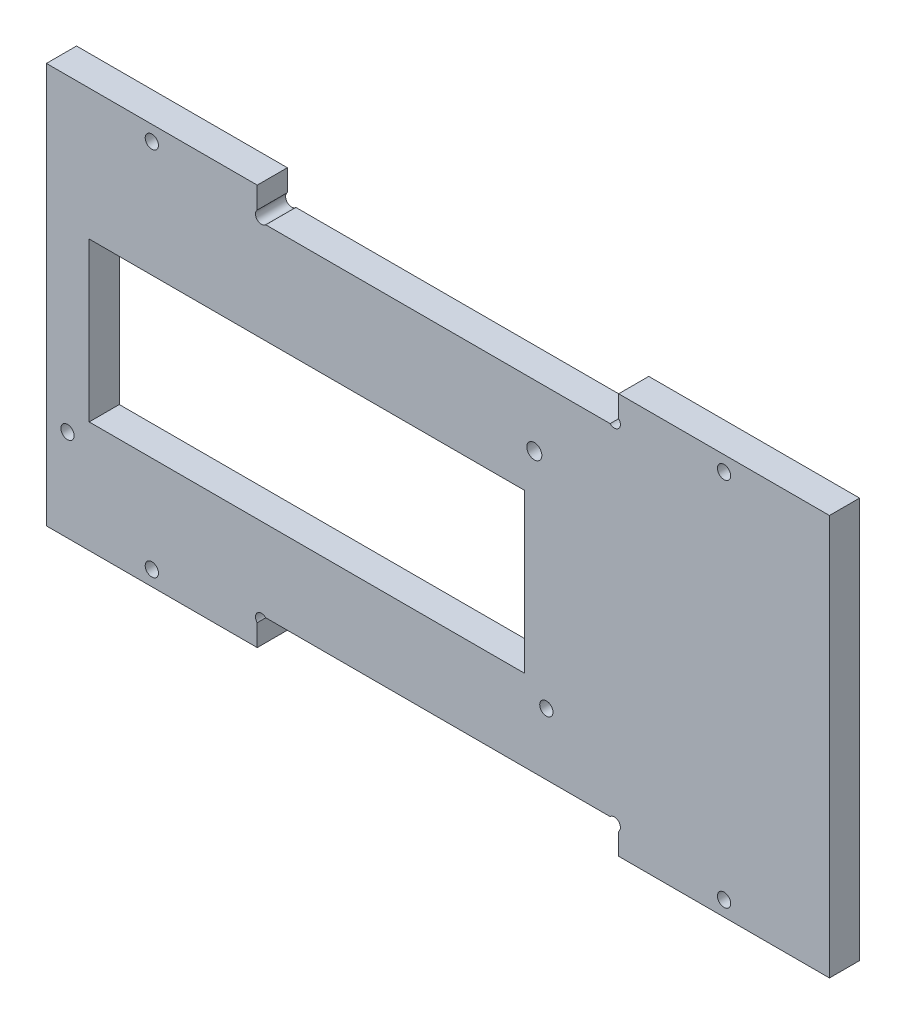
from build123d import *

# Parameters (mm, degrees)
ESQUISSE1_W               = 130
ESQUISSE1_H               = 66.5
BOSS_EXTRU_1_DEPTH        = 5
ENL_V_MAT_EXTRU_1_REACH   = 148.107
ESQUISSE2_R               = 1.25
ESQUISSE2_R_2             = 1.1
ENL_V_MAT_EXTRU_2_REACH   = 148.107
ESQUISSE3_W               = 72.3
ESQUISSE3_H               = 26.3
ENL_V_MAT_EXTRU_4_REACH   = 148.107
ESQUISSE6_W               = 60
ESQUISSE6_H               = 5
ENL_V_START               = -5
ESQUISSE7_R               = 1
ENL_V_MAT_EXTRU_5_DEPTH   = 5
ENL_V_MAT_EXTRU_6_REACH   = 148.107
ESQUISSE8_R               = 1.1
SYM_TRIE2_COPY_1_REACH    = 148.107
SYM_TRIE2_COPY_1_SKETCH_R = 1.1
ESQUISSE10_W              = 40
ESQUISSE10_H              = 6.5
ENL_V_MAT_EXTRU_7_DEPTH   = 1


with BuildPart() as part:
    # Esquisse1 → Boss.-Extru.1 (new body)
    with BuildSketch(Plane.XY):
        with Locations((65, 33.25)):
            Rectangle(ESQUISSE1_W, ESQUISSE1_H)
    extrude(amount=BOSS_EXTRU_1_DEPTH)

    # Esquisse2 → Enl_v. mat.-Extru.1 (cut, up to next)
    with BuildSketch(Plane.XY.offset(5), mode=Mode.PRIVATE) as enl_v_mat_extru_1_sk1:
        with Locations((81, 51.25)):
            Circle(ESQUISSE2_R)
    enl_v_mat_extru_1_tool1 = extrude(enl_v_mat_extru_1_sk1.sketch, amount=-ENL_V_MAT_EXTRU_1_REACH, mode=Mode.PRIVATE) & part.part
    # Esquisse2 → Enl_v. mat.-Extru.1 (cut, up to next)
    with BuildSketch(Plane.XY.offset(5), mode=Mode.PRIVATE) as enl_v_mat_extru_1_sk2:
        with Locations((83, 15.25)):
            Circle(ESQUISSE2_R_2)
    enl_v_mat_extru_1_tool2 = extrude(enl_v_mat_extru_1_sk2.sketch, amount=-ENL_V_MAT_EXTRU_1_REACH, mode=Mode.PRIVATE) & part.part
    # Esquisse2 → Enl_v. mat.-Extru.1 (cut, up to next)
    with BuildSketch(Plane.XY.offset(5), mode=Mode.PRIVATE) as enl_v_mat_extru_1_sk3:
        with Locations((3.5, 15.25)):
            Circle(ESQUISSE2_R_2)
    enl_v_mat_extru_1_tool3 = extrude(enl_v_mat_extru_1_sk3.sketch, amount=-ENL_V_MAT_EXTRU_1_REACH, mode=Mode.PRIVATE) & part.part
    add(enl_v_mat_extru_1_tool1.solids().sort_by_distance((81, 51.25, 5))[0], mode=Mode.SUBTRACT)
    add(enl_v_mat_extru_1_tool2.solids().sort_by_distance((83, 15.25, 5))[0], mode=Mode.SUBTRACT)
    add(enl_v_mat_extru_1_tool3.solids().sort_by_distance((3.5, 15.25, 5))[0], mode=Mode.SUBTRACT)

    # Esquisse3 → Enl_v. mat.-Extru.2 (cut, up to next)
    with BuildSketch(Plane.XY.offset(5), mode=Mode.PRIVATE) as enl_v_mat_extru_2_sk1:
        with Locations((43.25, 31.65)):
            Rectangle(ESQUISSE3_W, ESQUISSE3_H)
    enl_v_mat_extru_2_tool1 = extrude(enl_v_mat_extru_2_sk1.sketch, amount=-ENL_V_MAT_EXTRU_2_REACH, mode=Mode.PRIVATE) & part.part
    add(enl_v_mat_extru_2_tool1.solids().sort_by_distance((43.25, 31.65, 5))[0], mode=Mode.SUBTRACT)

    # Esquisse6 → Enl_v. mat.-Extru.4 (cut, up to next)
    with BuildSketch(Plane.XY.offset(5), mode=Mode.PRIVATE) as enl_v_mat_extru_4_sk1:
        with Locations((65, 2.5)):
            Rectangle(ESQUISSE6_W, ESQUISSE6_H)
    enl_v_mat_extru_4_tool1 = extrude(enl_v_mat_extru_4_sk1.sketch, amount=-ENL_V_MAT_EXTRU_4_REACH, mode=Mode.PRIVATE) & part.part
    # Esquisse6 → Enl_v. mat.-Extru.4 (cut, up to next)
    with BuildSketch(Plane.XY.offset(5), mode=Mode.PRIVATE) as enl_v_mat_extru_4_sk2:
        with Locations((65, 64)):
            Rectangle(ESQUISSE6_W, ESQUISSE6_H)
    enl_v_mat_extru_4_tool2 = extrude(enl_v_mat_extru_4_sk2.sketch, amount=-ENL_V_MAT_EXTRU_4_REACH, mode=Mode.PRIVATE) & part.part
    add(enl_v_mat_extru_4_tool1.solids().sort_by_distance((65, 2.5, 5))[0], mode=Mode.SUBTRACT)
    add(enl_v_mat_extru_4_tool2.solids().sort_by_distance((65, 64, 5))[0], mode=Mode.SUBTRACT)

    # Esquisse7 → Enl_v. mat.-Extru.5 (cut)
    with BuildSketch(Plane.XY.offset(5).offset(ENL_V_START)):
        with Locations((94.292893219, 4.292893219)):
            Circle(ESQUISSE7_R)
        with Locations((35.707106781, 4.292893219)):
            Circle(ESQUISSE7_R)
        with Locations((35.707106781, 62.207106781)):
            Circle(ESQUISSE7_R)
        with Locations((94.292893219, 62.207106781)):
            Circle(ESQUISSE7_R)
    extrude(amount=ENL_V_MAT_EXTRU_5_DEPTH, mode=Mode.SUBTRACT)

    # Esquisse8 → Enl_v. mat.-Extru.6 (cut, up to next)
    with BuildSketch(Plane.XY.offset(5), mode=Mode.PRIVATE) as enl_v_mat_extru_6_sk1:
        with Locations((17.5, 2.5)):
            Circle(ESQUISSE8_R)
    enl_v_mat_extru_6_tool1 = extrude(enl_v_mat_extru_6_sk1.sketch, amount=-ENL_V_MAT_EXTRU_6_REACH, mode=Mode.PRIVATE) & part.part
    enl_v_mat_extru_6 = enl_v_mat_extru_6_tool1.solids().sort_by_distance((17.5, 2.5, 5))[0]
    add(enl_v_mat_extru_6, mode=Mode.SUBTRACT)

    # Sym_trie1: Enl_v. mat.-Extru.6 across plane
    add(enl_v_mat_extru_6.mirror(Plane(origin=(65, 0, 0), x_dir=(0, 0, 1), z_dir=(1, 0, 0))), mode=Mode.SUBTRACT)

    # Sym_trie2: Enl_v. mat.-Extru.6 across plane
    add(enl_v_mat_extru_6.mirror(Plane.ZX.offset(33.25)), mode=Mode.SUBTRACT)

    # Sym_trie2 copy 1 sketch → Sym_trie2 copy 1 (cut, up to next)
    with BuildSketch(Plane(origin=(130, 66.5, 5), x_dir=(-1, 0, 0), z_dir=(0, 0, 1)), mode=Mode.PRIVATE) as sym_trie2_copy_1_sk1:
        with Locations((17.5, 2.5)):
            Circle(SYM_TRIE2_COPY_1_SKETCH_R)
    sym_trie2_copy_1_tool1 = extrude(sym_trie2_copy_1_sk1.sketch, amount=-SYM_TRIE2_COPY_1_REACH, mode=Mode.PRIVATE) & part.part
    add(sym_trie2_copy_1_tool1.solids().sort_by_distance((112.5, 64, 5))[0], mode=Mode.SUBTRACT)

    # Esquisse10 → Enl_v. mat.-Extru.7 (cut)
    with BuildSketch(Plane(origin=(0, 0, 0), x_dir=(-1, 0, 0), z_dir=(0, 0, -1))):
        with Locations((-58.4, 51.55)):
            Rectangle(ESQUISSE10_W, ESQUISSE10_H)
    extrude(amount=-ENL_V_MAT_EXTRU_7_DEPTH, mode=Mode.SUBTRACT)


solid = part.part
